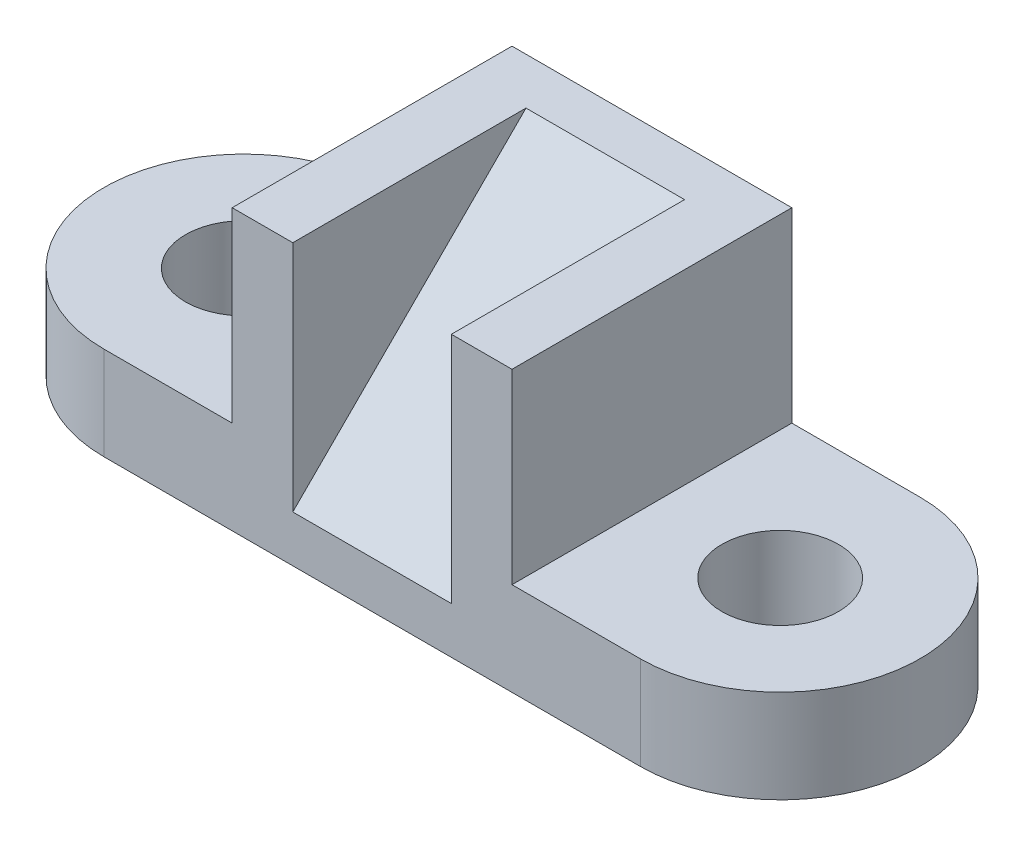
from build123d import *

# Parameters (mm, degrees)
SKETCH1_R          = 12.5
EXTRUDE1_DEPTH     = 20
SKETCH4_W          = 30
SKETCH4_H          = 60
EXTRUDE2_DEPTH     = 40
CUT_EXTRUDE1_DEPTH = 17


with BuildPart() as part:
    # Sketch1 → Extrude1 (new body)
    with BuildSketch(Plane(origin=(0, 0, 0), x_dir=(1, 0, 0), z_dir=(0, 1, 0))):
        with BuildLine():
            Line((0, -30), (-57.5, -30))
            ThreePointArc((-57.5, -30), (-87.5, 0), (-57.5, 30))
            Line((-57.5, 30), (0, 30))
            Line((0, 30), (0, -30))
        make_face()
        with Locations(Location((-57.5, 0, 0), (0, 0, 270))):
            Circle(SKETCH1_R, mode=Mode.SUBTRACT)
    extrude(amount=EXTRUDE1_DEPTH)

    # Sketch4 → Extrude2 (add)
    with BuildSketch(Plane(origin=(0, 20, 0), x_dir=(-1, 0, 0), z_dir=(0, 1, 0))):
        with Locations((15, 0)):
            Rectangle(SKETCH4_W, SKETCH4_H)
    extrude(amount=EXTRUDE2_DEPTH)

    # Sketch5 → Cut-Extrude1 (cut)
    with BuildSketch(Plane(origin=(0, 0, 0), x_dir=(0, 0, -1), z_dir=(1, 0, 0))):
        Polygon((-30, 10), (20, 60), (-30, 60), align=None)
    extrude(amount=-CUT_EXTRUDE1_DEPTH, mode=Mode.SUBTRACT)

    # Mirror1: part across plane


with BuildPart() as part_1:
    add(part.part)
    add(part.part.mirror(Plane(origin=(0, 20, -30), x_dir=(0, 0, 1), z_dir=(-1, 0, 0))))


solid = part_1.part
